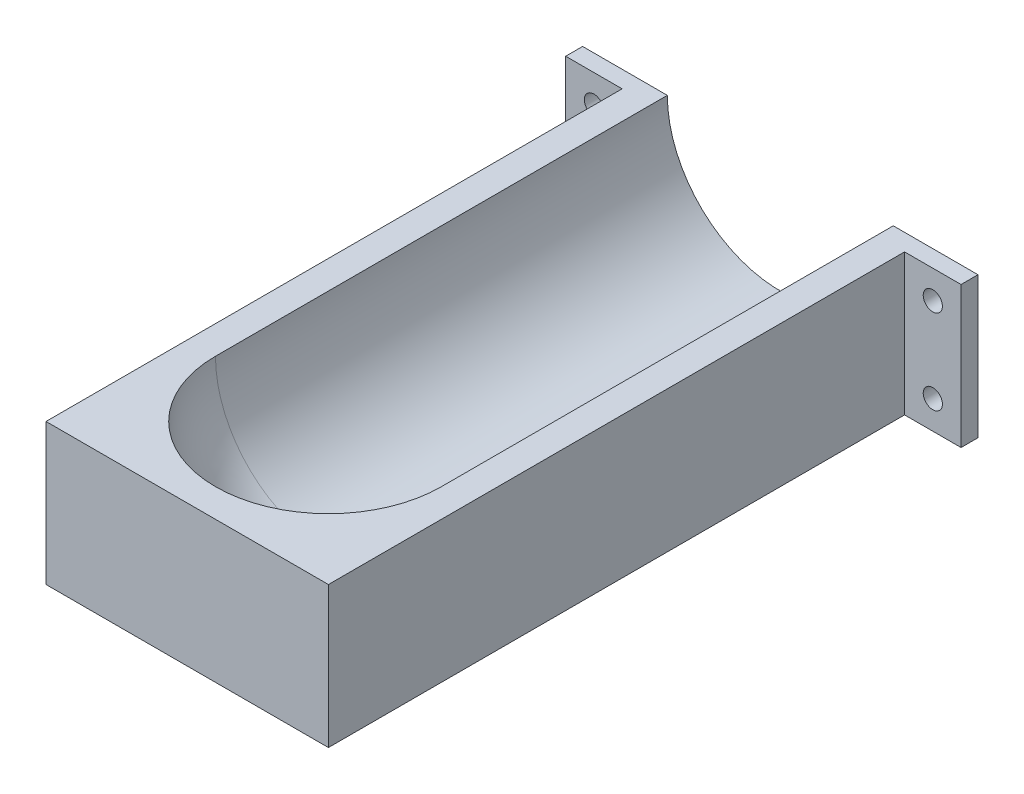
ISO-10303-21;
HEADER;
FILE_DESCRIPTION(('STEP AP214'),'2;1');
FILE_NAME('part.step','',(''),(''),'','','');
FILE_SCHEMA(('AUTOMOTIVE_DESIGN { 1 0 10303 214 1 1 1 1 }'));
ENDSEC;
DATA;
#1=APPLICATION_CONTEXT('core data for automotive mechanical design processes');
#2=APPLICATION_PROTOCOL_DEFINITION('international standard','automotive_design',2000,#1);
#3=PRODUCT_CONTEXT('',#1,'mechanical');
#4=PRODUCT('Part','Part','',(#3));
#5=PRODUCT_RELATED_PRODUCT_CATEGORY('part','',(#4));
#6=PRODUCT_DEFINITION_FORMATION('','',#4);
#7=PRODUCT_DEFINITION_CONTEXT('part definition',#1,'design');
#8=PRODUCT_DEFINITION('design','',#6,#7);
#9=PRODUCT_DEFINITION_SHAPE('','',#8);
#10=(LENGTH_UNIT() NAMED_UNIT(*) SI_UNIT(.MILLI.,.METRE.));
#11=(NAMED_UNIT(*) PLANE_ANGLE_UNIT() SI_UNIT($,.RADIAN.));
#12=(NAMED_UNIT(*) SI_UNIT($,.STERADIAN.) SOLID_ANGLE_UNIT());
#13=UNCERTAINTY_MEASURE_WITH_UNIT(LENGTH_MEASURE(1.E-05),#10,'distance_accuracy_value','');
#14=(GEOMETRIC_REPRESENTATION_CONTEXT(3) GLOBAL_UNCERTAINTY_ASSIGNED_CONTEXT((#13)) GLOBAL_UNIT_ASSIGNED_CONTEXT((#10,
#11,#12)) REPRESENTATION_CONTEXT('',''));
#15=CARTESIAN_POINT('',(0.,0.,0.));
#16=DIRECTION('',(0.,0.,1.));
#17=DIRECTION('',(1.,0.,0.));
#18=AXIS2_PLACEMENT_3D('',#15,#16,#17);
#19=CARTESIAN_POINT('',(0.,0.,105.));
#20=DIRECTION('',(1.,0.,0.));
#21=DIRECTION('',(0.,0.,-1.));
#22=AXIS2_PLACEMENT_3D('',#19,#20,#21);
#23=PLANE('',#22);
#24=DIRECTION('',(0.,0.,-1.));
#25=VECTOR('',#24,1.);
#26=CARTESIAN_POINT('',(0.,25.,105.));
#27=LINE('',#26,#25);
#28=CARTESIAN_POINT('',(0.,25.,105.));
#29=VERTEX_POINT('',#28);
#30=CARTESIAN_POINT('',(0.,25.,3.));
#31=VERTEX_POINT('',#30);
#32=EDGE_CURVE('E212',#29,#31,#27,.T.);
#33=ORIENTED_EDGE('',*,*,#32,.T.);
#34=DIRECTION('',(0.,-1.,0.));
#35=VECTOR('',#34,1.);
#36=CARTESIAN_POINT('',(0.,25.,3.));
#37=LINE('',#36,#35);
#38=CARTESIAN_POINT('',(0.,0.,3.));
#39=VERTEX_POINT('',#38);
#40=EDGE_CURVE('E149',#31,#39,#37,.T.);
#41=ORIENTED_EDGE('',*,*,#40,.T.);
#42=DIRECTION('',(0.,0.,-1.));
#43=VECTOR('',#42,1.);
#44=CARTESIAN_POINT('',(0.,0.,105.));
#45=LINE('',#44,#43);
#46=CARTESIAN_POINT('',(0.,0.,105.));
#47=VERTEX_POINT('',#46);
#48=EDGE_CURVE('E147',#47,#39,#45,.T.);
#49=ORIENTED_EDGE('',*,*,#48,.F.);
#50=DIRECTION('',(0.,-1.,0.));
#51=VECTOR('',#50,1.);
#52=CARTESIAN_POINT('',(0.,0.,105.));
#53=LINE('',#52,#51);
#54=EDGE_CURVE('E198',#29,#47,#53,.T.);
#55=ORIENTED_EDGE('',*,*,#54,.F.);
#56=EDGE_LOOP('',(#33,#41,#49,#55));
#57=FACE_BOUND('',#56,.T.);
#58=ADVANCED_FACE('F43',(#57),#23,.F.);
#59=CARTESIAN_POINT('',(0.,0.,105.));
#60=DIRECTION('',(0.,1.,0.));
#61=DIRECTION('',(0.,0.,1.));
#62=AXIS2_PLACEMENT_3D('',#59,#60,#61);
#63=PLANE('',#62);
#64=DIRECTION('',(1.,0.,0.));
#65=VECTOR('',#64,1.);
#66=CARTESIAN_POINT('',(0.,0.,0.));
#67=LINE('',#66,#65);
#68=CARTESIAN_POINT('',(-10.,0.,0.));
#69=VERTEX_POINT('',#68);
#70=CARTESIAN_POINT('',(60.,0.,0.));
#71=VERTEX_POINT('',#70);
#72=EDGE_CURVE('E195',#69,#71,#67,.T.);
#73=ORIENTED_EDGE('',*,*,#72,.T.);
#74=DIRECTION('',(0.,0.,-1.));
#75=VECTOR('',#74,1.);
#76=CARTESIAN_POINT('',(60.,0.,3.));
#77=LINE('',#76,#75);
#78=CARTESIAN_POINT('',(60.,0.,3.));
#79=VERTEX_POINT('',#78);
#80=EDGE_CURVE('E180',#79,#71,#77,.T.);
#81=ORIENTED_EDGE('',*,*,#80,.F.);
#82=DIRECTION('',(-1.,0.,0.));
#83=VECTOR('',#82,1.);
#84=CARTESIAN_POINT('',(50.,0.,3.));
#85=LINE('',#84,#83);
#86=CARTESIAN_POINT('',(50.,0.,3.));
#87=VERTEX_POINT('',#86);
#88=EDGE_CURVE('E172',#79,#87,#85,.T.);
#89=ORIENTED_EDGE('',*,*,#88,.T.);
#90=DIRECTION('',(0.,0.,-1.));
#91=VECTOR('',#90,1.);
#92=CARTESIAN_POINT('',(50.,0.,105.));
#93=LINE('',#92,#91);
#94=CARTESIAN_POINT('',(50.,0.,105.));
#95=VERTEX_POINT('',#94);
#96=EDGE_CURVE('E226',#95,#87,#93,.T.);
#97=ORIENTED_EDGE('',*,*,#96,.F.);
#98=DIRECTION('',(1.,0.,0.));
#99=VECTOR('',#98,1.);
#100=CARTESIAN_POINT('',(0.,0.,105.));
#101=LINE('',#100,#99);
#102=EDGE_CURVE('E202',#47,#95,#101,.T.);
#103=ORIENTED_EDGE('',*,*,#102,.F.);
#104=ORIENTED_EDGE('',*,*,#48,.T.);
#105=DIRECTION('',(-1.,0.,0.));
#106=VECTOR('',#105,1.);
#107=CARTESIAN_POINT('',(0.,0.,3.));
#108=LINE('',#107,#106);
#109=CARTESIAN_POINT('',(-10.,0.,3.));
#110=VERTEX_POINT('',#109);
#111=EDGE_CURVE('E61',#39,#110,#108,.T.);
#112=ORIENTED_EDGE('',*,*,#111,.T.);
#113=DIRECTION('',(0.,0.,-1.));
#114=VECTOR('',#113,1.);
#115=CARTESIAN_POINT('',(-10.,0.,3.));
#116=LINE('',#115,#114);
#117=EDGE_CURVE('E128',#110,#69,#116,.T.);
#118=ORIENTED_EDGE('',*,*,#117,.T.);
#119=EDGE_LOOP('',(#73,#81,#89,#97,#103,#104,#112,#118));
#120=FACE_BOUND('',#119,.T.);
#121=ADVANCED_FACE('F145',(#120),#63,.F.);
#122=CARTESIAN_POINT('',(50.,0.,105.));
#123=DIRECTION('',(-1.,0.,0.));
#124=DIRECTION('',(0.,0.,1.));
#125=AXIS2_PLACEMENT_3D('',#122,#123,#124);
#126=PLANE('',#125);
#127=ORIENTED_EDGE('',*,*,#96,.T.);
#128=DIRECTION('',(0.,1.,0.));
#129=VECTOR('',#128,1.);
#130=CARTESIAN_POINT('',(50.,25.,3.));
#131=LINE('',#130,#129);
#132=CARTESIAN_POINT('',(50.,25.,3.));
#133=VERTEX_POINT('',#132);
#134=EDGE_CURVE('E163',#87,#133,#131,.T.);
#135=ORIENTED_EDGE('',*,*,#134,.T.);
#136=DIRECTION('',(0.,0.,-1.));
#137=VECTOR('',#136,1.);
#138=CARTESIAN_POINT('',(50.,25.,105.));
#139=LINE('',#138,#137);
#140=CARTESIAN_POINT('',(50.,25.,105.));
#141=VERTEX_POINT('',#140);
#142=EDGE_CURVE('E222',#141,#133,#139,.T.);
#143=ORIENTED_EDGE('',*,*,#142,.F.);
#144=DIRECTION('',(0.,1.,0.));
#145=VECTOR('',#144,1.);
#146=CARTESIAN_POINT('',(50.,0.,105.));
#147=LINE('',#146,#145);
#148=EDGE_CURVE('E206',#95,#141,#147,.T.);
#149=ORIENTED_EDGE('',*,*,#148,.F.);
#150=EDGE_LOOP('',(#127,#135,#143,#149));
#151=FACE_BOUND('',#150,.T.);
#152=ADVANCED_FACE('F300',(#151),#126,.F.);
#153=CARTESIAN_POINT('',(0.,25.,105.));
#154=DIRECTION('',(0.,-1.,0.));
#155=DIRECTION('',(0.,0.,-1.));
#156=AXIS2_PLACEMENT_3D('',#153,#154,#155);
#157=PLANE('',#156);
#158=CARTESIAN_POINT('',(25.,25.,80.));
#159=DIRECTION('',(0.,-1.,0.));
#160=DIRECTION('',(0.,0.,-1.));
#161=AXIS2_PLACEMENT_3D('',#158,#159,#160);
#162=CIRCLE('',#161,20.);
#163=CARTESIAN_POINT('',(45.,25.,80.));
#164=VERTEX_POINT('',#163);
#165=CARTESIAN_POINT('',(25.,25.,100.));
#166=VERTEX_POINT('',#165);
#167=EDGE_CURVE('E53',#164,#166,#162,.T.);
#168=ORIENTED_EDGE('',*,*,#167,.T.);
#169=CARTESIAN_POINT('',(25.,25.,80.));
#170=DIRECTION('',(0.,-1.,0.));
#171=DIRECTION('',(0.,0.,-1.));
#172=AXIS2_PLACEMENT_3D('',#169,#170,#171);
#173=CIRCLE('',#172,20.);
#174=CARTESIAN_POINT('',(5.00000000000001,25.,80.));
#175=VERTEX_POINT('',#174);
#176=EDGE_CURVE('E12',#166,#175,#173,.T.);
#177=ORIENTED_EDGE('',*,*,#176,.T.);
#178=DIRECTION('',(0.,0.,-1.));
#179=VECTOR('',#178,1.);
#180=CARTESIAN_POINT('',(5.00000000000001,25.,149.721359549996));
#181=LINE('',#180,#179);
#182=CARTESIAN_POINT('',(5.00000000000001,25.,0.));
#183=VERTEX_POINT('',#182);
#184=EDGE_CURVE('E191',#175,#183,#181,.T.);
#185=ORIENTED_EDGE('',*,*,#184,.T.);
#186=DIRECTION('',(-1.,0.,0.));
#187=VECTOR('',#186,1.);
#188=CARTESIAN_POINT('',(0.,25.,0.));
#189=LINE('',#188,#187);
#190=CARTESIAN_POINT('',(-10.,25.,0.));
#191=VERTEX_POINT('',#190);
#192=EDGE_CURVE('E215',#183,#191,#189,.T.);
#193=ORIENTED_EDGE('',*,*,#192,.T.);
#194=DIRECTION('',(0.,0.,-1.));
#195=VECTOR('',#194,1.);
#196=CARTESIAN_POINT('',(-10.,25.,3.));
#197=LINE('',#196,#195);
#198=CARTESIAN_POINT('',(-10.,25.,3.));
#199=VERTEX_POINT('',#198);
#200=EDGE_CURVE('E137',#199,#191,#197,.T.);
#201=ORIENTED_EDGE('',*,*,#200,.F.);
#202=DIRECTION('',(1.,0.,0.));
#203=VECTOR('',#202,1.);
#204=CARTESIAN_POINT('',(0.,25.,3.));
#205=LINE('',#204,#203);
#206=EDGE_CURVE('E138',#199,#31,#205,.T.);
#207=ORIENTED_EDGE('',*,*,#206,.T.);
#208=ORIENTED_EDGE('',*,*,#32,.F.);
#209=DIRECTION('',(-1.,0.,0.));
#210=VECTOR('',#209,1.);
#211=CARTESIAN_POINT('',(0.,25.,105.));
#212=LINE('',#211,#210);
#213=EDGE_CURVE('E209',#141,#29,#212,.T.);
#214=ORIENTED_EDGE('',*,*,#213,.F.);
#215=ORIENTED_EDGE('',*,*,#142,.T.);
#216=DIRECTION('',(1.,0.,0.));
#217=VECTOR('',#216,1.);
#218=CARTESIAN_POINT('',(50.,25.,3.));
#219=LINE('',#218,#217);
#220=CARTESIAN_POINT('',(60.,25.,3.));
#221=VERTEX_POINT('',#220);
#222=EDGE_CURVE('E69',#133,#221,#219,.T.);
#223=ORIENTED_EDGE('',*,*,#222,.T.);
#224=DIRECTION('',(0.,0.,-1.));
#225=VECTOR('',#224,1.);
#226=CARTESIAN_POINT('',(60.,25.,3.));
#227=LINE('',#226,#225);
#228=CARTESIAN_POINT('',(60.,25.,0.));
#229=VERTEX_POINT('',#228);
#230=EDGE_CURVE('E176',#221,#229,#227,.T.);
#231=ORIENTED_EDGE('',*,*,#230,.T.);
#232=CARTESIAN_POINT('',(45.,25.,0.));
#233=VERTEX_POINT('',#232);
#234=EDGE_CURVE('E203',#229,#233,#189,.T.);
#235=ORIENTED_EDGE('',*,*,#234,.T.);
#236=DIRECTION('',(0.,0.,-1.));
#237=VECTOR('',#236,1.);
#238=CARTESIAN_POINT('',(45.,25.,149.721359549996));
#239=LINE('',#238,#237);
#240=EDGE_CURVE('E192',#164,#233,#239,.T.);
#241=ORIENTED_EDGE('',*,*,#240,.F.);
#242=EDGE_LOOP('',(#168,#177,#185,#193,#201,#207,#208,#214,#215,#223,#231,#235,#241));
#243=FACE_BOUND('',#242,.T.);
#244=ADVANCED_FACE('F291',(#243),#157,.F.);
#245=CARTESIAN_POINT('',(0.,0.,105.));
#246=DIRECTION('',(0.,0.,-1.));
#247=DIRECTION('',(-1.,0.,0.));
#248=AXIS2_PLACEMENT_3D('',#245,#246,#247);
#249=PLANE('',#248);
#250=ORIENTED_EDGE('',*,*,#54,.T.);
#251=ORIENTED_EDGE('',*,*,#102,.T.);
#252=ORIENTED_EDGE('',*,*,#148,.T.);
#253=ORIENTED_EDGE('',*,*,#213,.T.);
#254=EDGE_LOOP('',(#250,#251,#252,#253));
#255=FACE_BOUND('',#254,.T.);
#256=ADVANCED_FACE('F278',(#255),#249,.F.);
#257=CARTESIAN_POINT('',(0.,0.,0.));
#258=DIRECTION('',(0.,0.,-1.));
#259=DIRECTION('',(-1.,0.,0.));
#260=AXIS2_PLACEMENT_3D('',#257,#258,#259);
#261=PLANE('',#260);
#262=CARTESIAN_POINT('',(55.,5.,0.));
#263=DIRECTION('',(0.,0.,-1.));
#264=DIRECTION('',(-1.,0.,0.));
#265=AXIS2_PLACEMENT_3D('',#262,#263,#264);
#266=CIRCLE('',#265,1.7);
#267=CARTESIAN_POINT('',(53.3,5.,0.));
#268=VERTEX_POINT('',#267);
#269=EDGE_CURVE('E246',#268,#268,#266,.T.);
#270=ORIENTED_EDGE('',*,*,#269,.F.);
#271=EDGE_LOOP('',(#270));
#272=FACE_BOUND('',#271,.T.);
#273=CARTESIAN_POINT('',(-4.99999999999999,20.,0.));
#274=DIRECTION('',(0.,0.,-1.));
#275=DIRECTION('',(-1.,0.,0.));
#276=AXIS2_PLACEMENT_3D('',#273,#274,#275);
#277=CIRCLE('',#276,1.7);
#278=CARTESIAN_POINT('',(-6.69999999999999,20.,0.));
#279=VERTEX_POINT('',#278);
#280=EDGE_CURVE('E264',#279,#279,#277,.T.);
#281=ORIENTED_EDGE('',*,*,#280,.F.);
#282=EDGE_LOOP('',(#281));
#283=FACE_BOUND('',#282,.T.);
#284=CARTESIAN_POINT('',(-5.,5.,0.));
#285=DIRECTION('',(0.,0.,-1.));
#286=DIRECTION('',(-1.,0.,0.));
#287=AXIS2_PLACEMENT_3D('',#284,#285,#286);
#288=CIRCLE('',#287,1.7);
#289=CARTESIAN_POINT('',(-6.7,5.,0.));
#290=VERTEX_POINT('',#289);
#291=EDGE_CURVE('E260',#290,#290,#288,.T.);
#292=ORIENTED_EDGE('',*,*,#291,.F.);
#293=EDGE_LOOP('',(#292));
#294=FACE_BOUND('',#293,.T.);
#295=CARTESIAN_POINT('',(55.,20.,0.));
#296=DIRECTION('',(0.,0.,-1.));
#297=DIRECTION('',(-1.,0.,0.));
#298=AXIS2_PLACEMENT_3D('',#295,#296,#297);
#299=CIRCLE('',#298,1.7);
#300=CARTESIAN_POINT('',(53.3,20.,0.));
#301=VERTEX_POINT('',#300);
#302=EDGE_CURVE('E241',#301,#301,#299,.T.);
#303=ORIENTED_EDGE('',*,*,#302,.F.);
#304=EDGE_LOOP('',(#303));
#305=FACE_BOUND('',#304,.T.);
#306=CARTESIAN_POINT('',(25.,25.,0.));
#307=DIRECTION('',(0.,0.,-1.));
#308=DIRECTION('',(1.,0.,0.));
#309=AXIS2_PLACEMENT_3D('',#306,#307,#308);
#310=CIRCLE('',#309,20.);
#311=EDGE_CURVE('E184',#233,#183,#310,.T.);
#312=ORIENTED_EDGE('',*,*,#311,.F.);
#313=ORIENTED_EDGE('',*,*,#234,.F.);
#314=DIRECTION('',(0.,-1.,0.));
#315=VECTOR('',#314,1.);
#316=CARTESIAN_POINT('',(60.,25.,0.));
#317=LINE('',#316,#315);
#318=EDGE_CURVE('E161',#229,#71,#317,.T.);
#319=ORIENTED_EDGE('',*,*,#318,.T.);
#320=ORIENTED_EDGE('',*,*,#72,.F.);
#321=DIRECTION('',(0.,1.,0.));
#322=VECTOR('',#321,1.);
#323=CARTESIAN_POINT('',(-10.,25.,0.));
#324=LINE('',#323,#322);
#325=EDGE_CURVE('E134',#69,#191,#324,.T.);
#326=ORIENTED_EDGE('',*,*,#325,.T.);
#327=ORIENTED_EDGE('',*,*,#192,.F.);
#328=EDGE_LOOP('',(#312,#313,#319,#320,#326,#327));
#329=FACE_BOUND('',#328,.T.);
#330=ADVANCED_FACE('F274',(#272,#283,#294,#305,#329),#261,.T.);
#331=CARTESIAN_POINT('',(25.,25.,149.721359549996));
#332=DIRECTION('',(0.,0.,-1.));
#333=DIRECTION('',(-1.,0.,0.));
#334=AXIS2_PLACEMENT_3D('',#331,#332,#333);
#335=CYLINDRICAL_SURFACE('',#334,20.);
#336=ORIENTED_EDGE('',*,*,#184,.F.);
#337=CARTESIAN_POINT('',(25.,25.,80.));
#338=DIRECTION('',(0.,0.,-1.));
#339=DIRECTION('',(-1.,0.,0.));
#340=AXIS2_PLACEMENT_3D('',#337,#338,#339);
#341=CIRCLE('',#340,20.);
#342=EDGE_CURVE('E232',#175,#164,#341,.F.);
#343=ORIENTED_EDGE('',*,*,#342,.T.);
#344=ORIENTED_EDGE('',*,*,#240,.T.);
#345=ORIENTED_EDGE('',*,*,#311,.T.);
#346=EDGE_LOOP('',(#336,#343,#344,#345));
#347=FACE_BOUND('',#346,.T.);
#348=ADVANCED_FACE('F277',(#347),#335,.F.);
#349=CARTESIAN_POINT('',(25.,25.,80.));
#350=DIRECTION('',(0.,0.,-1.));
#351=DIRECTION('',(-1.,0.,0.));
#352=AXIS2_PLACEMENT_3D('',#349,#350,#351);
#353=SPHERICAL_SURFACE('',#352,20.);
#354=ORIENTED_EDGE('',*,*,#342,.F.);
#355=ORIENTED_EDGE('',*,*,#176,.F.);
#356=ORIENTED_EDGE('',*,*,#167,.F.);
#357=EDGE_LOOP('',(#354,#355,#356));
#358=FACE_BOUND('',#357,.T.);
#359=ADVANCED_FACE('F45',(#358),#353,.F.);
#360=CARTESIAN_POINT('',(60.,25.,3.));
#361=DIRECTION('',(1.,0.,0.));
#362=DIRECTION('',(0.,1.,0.));
#363=AXIS2_PLACEMENT_3D('',#360,#361,#362);
#364=PLANE('',#363);
#365=ORIENTED_EDGE('',*,*,#318,.F.);
#366=ORIENTED_EDGE('',*,*,#230,.F.);
#367=DIRECTION('',(0.,-1.,0.));
#368=VECTOR('',#367,1.);
#369=CARTESIAN_POINT('',(60.,25.,3.));
#370=LINE('',#369,#368);
#371=EDGE_CURVE('E168',#221,#79,#370,.T.);
#372=ORIENTED_EDGE('',*,*,#371,.T.);
#373=ORIENTED_EDGE('',*,*,#80,.T.);
#374=EDGE_LOOP('',(#365,#366,#372,#373));
#375=FACE_BOUND('',#374,.T.);
#376=ADVANCED_FACE('F294',(#375),#364,.T.);
#377=CARTESIAN_POINT('',(0.,0.,3.));
#378=DIRECTION('',(0.,0.,1.));
#379=DIRECTION('',(1.,0.,0.));
#380=AXIS2_PLACEMENT_3D('',#377,#378,#379);
#381=PLANE('',#380);
#382=CARTESIAN_POINT('',(55.,5.,3.));
#383=DIRECTION('',(0.,0.,1.));
#384=DIRECTION('',(1.,0.,0.));
#385=AXIS2_PLACEMENT_3D('',#382,#383,#384);
#386=CIRCLE('',#385,1.7);
#387=CARTESIAN_POINT('',(56.7,5.,3.));
#388=VERTEX_POINT('',#387);
#389=EDGE_CURVE('E47',#388,#388,#386,.T.);
#390=ORIENTED_EDGE('',*,*,#389,.F.);
#391=EDGE_LOOP('',(#390));
#392=FACE_BOUND('',#391,.T.);
#393=CARTESIAN_POINT('',(55.,20.,3.));
#394=DIRECTION('',(0.,0.,1.));
#395=DIRECTION('',(1.,0.,0.));
#396=AXIS2_PLACEMENT_3D('',#393,#394,#395);
#397=CIRCLE('',#396,1.7);
#398=CARTESIAN_POINT('',(56.7,20.,3.));
#399=VERTEX_POINT('',#398);
#400=EDGE_CURVE('E159',#399,#399,#397,.T.);
#401=ORIENTED_EDGE('',*,*,#400,.F.);
#402=EDGE_LOOP('',(#401));
#403=FACE_BOUND('',#402,.T.);
#404=ORIENTED_EDGE('',*,*,#134,.F.);
#405=ORIENTED_EDGE('',*,*,#88,.F.);
#406=ORIENTED_EDGE('',*,*,#371,.F.);
#407=ORIENTED_EDGE('',*,*,#222,.F.);
#408=EDGE_LOOP('',(#404,#405,#406,#407));
#409=FACE_BOUND('',#408,.T.);
#410=ADVANCED_FACE('F297',(#392,#403,#409),#381,.T.);
#411=CARTESIAN_POINT('',(-10.,25.,3.));
#412=DIRECTION('',(-1.,0.,0.));
#413=DIRECTION('',(0.,-1.,0.));
#414=AXIS2_PLACEMENT_3D('',#411,#412,#413);
#415=PLANE('',#414);
#416=ORIENTED_EDGE('',*,*,#325,.F.);
#417=ORIENTED_EDGE('',*,*,#117,.F.);
#418=DIRECTION('',(0.,1.,0.));
#419=VECTOR('',#418,1.);
#420=CARTESIAN_POINT('',(-10.,25.,3.));
#421=LINE('',#420,#419);
#422=EDGE_CURVE('E131',#110,#199,#421,.T.);
#423=ORIENTED_EDGE('',*,*,#422,.T.);
#424=ORIENTED_EDGE('',*,*,#200,.T.);
#425=EDGE_LOOP('',(#416,#417,#423,#424));
#426=FACE_BOUND('',#425,.T.);
#427=ADVANCED_FACE('F129',(#426),#415,.T.);
#428=CARTESIAN_POINT('',(0.,0.,3.));
#429=DIRECTION('',(0.,0.,-1.));
#430=DIRECTION('',(-1.,0.,0.));
#431=AXIS2_PLACEMENT_3D('',#428,#429,#430);
#432=PLANE('',#431);
#433=CARTESIAN_POINT('',(-4.99999999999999,20.,3.));
#434=DIRECTION('',(0.,0.,-1.));
#435=DIRECTION('',(-1.,0.,0.));
#436=AXIS2_PLACEMENT_3D('',#433,#434,#435);
#437=CIRCLE('',#436,1.7);
#438=CARTESIAN_POINT('',(-6.69999999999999,20.,3.));
#439=VERTEX_POINT('',#438);
#440=EDGE_CURVE('E245',#439,#439,#437,.T.);
#441=ORIENTED_EDGE('',*,*,#440,.T.);
#442=EDGE_LOOP('',(#441));
#443=FACE_BOUND('',#442,.T.);
#444=CARTESIAN_POINT('',(-5.,5.,3.));
#445=DIRECTION('',(0.,0.,-1.));
#446=DIRECTION('',(-1.,0.,0.));
#447=AXIS2_PLACEMENT_3D('',#444,#445,#446);
#448=CIRCLE('',#447,1.7);
#449=CARTESIAN_POINT('',(-6.7,5.,3.));
#450=VERTEX_POINT('',#449);
#451=EDGE_CURVE('E242',#450,#450,#448,.T.);
#452=ORIENTED_EDGE('',*,*,#451,.T.);
#453=EDGE_LOOP('',(#452));
#454=FACE_BOUND('',#453,.T.);
#455=ORIENTED_EDGE('',*,*,#40,.F.);
#456=ORIENTED_EDGE('',*,*,#206,.F.);
#457=ORIENTED_EDGE('',*,*,#422,.F.);
#458=ORIENTED_EDGE('',*,*,#111,.F.);
#459=EDGE_LOOP('',(#455,#456,#457,#458));
#460=FACE_BOUND('',#459,.T.);
#461=ADVANCED_FACE('F140',(#443,#454,#460),#432,.F.);
#462=CARTESIAN_POINT('',(55.,20.,105.));
#463=DIRECTION('',(0.,0.,-1.));
#464=DIRECTION('',(-1.,0.,0.));
#465=AXIS2_PLACEMENT_3D('',#462,#463,#464);
#466=CYLINDRICAL_SURFACE('',#465,1.7);
#467=ORIENTED_EDGE('',*,*,#400,.T.);
#468=EDGE_LOOP('',(#467));
#469=FACE_BOUND('',#468,.T.);
#470=ORIENTED_EDGE('',*,*,#302,.T.);
#471=EDGE_LOOP('',(#470));
#472=FACE_BOUND('',#471,.T.);
#473=ADVANCED_FACE('F337',(#469,#472),#466,.F.);
#474=CARTESIAN_POINT('',(-5.,5.,105.));
#475=DIRECTION('',(0.,0.,-1.));
#476=DIRECTION('',(-1.,0.,0.));
#477=AXIS2_PLACEMENT_3D('',#474,#475,#476);
#478=CYLINDRICAL_SURFACE('',#477,1.7);
#479=ORIENTED_EDGE('',*,*,#291,.T.);
#480=EDGE_LOOP('',(#479));
#481=FACE_BOUND('',#480,.T.);
#482=ORIENTED_EDGE('',*,*,#451,.F.);
#483=EDGE_LOOP('',(#482));
#484=FACE_BOUND('',#483,.T.);
#485=ADVANCED_FACE('F340',(#481,#484),#478,.F.);
#486=CARTESIAN_POINT('',(-4.99999999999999,20.,105.));
#487=DIRECTION('',(0.,0.,-1.));
#488=DIRECTION('',(-1.,0.,0.));
#489=AXIS2_PLACEMENT_3D('',#486,#487,#488);
#490=CYLINDRICAL_SURFACE('',#489,1.7);
#491=ORIENTED_EDGE('',*,*,#280,.T.);
#492=EDGE_LOOP('',(#491));
#493=FACE_BOUND('',#492,.T.);
#494=ORIENTED_EDGE('',*,*,#440,.F.);
#495=EDGE_LOOP('',(#494));
#496=FACE_BOUND('',#495,.T.);
#497=ADVANCED_FACE('F344',(#493,#496),#490,.F.);
#498=CARTESIAN_POINT('',(55.,5.,105.));
#499=DIRECTION('',(0.,0.,-1.));
#500=DIRECTION('',(-1.,0.,0.));
#501=AXIS2_PLACEMENT_3D('',#498,#499,#500);
#502=CYLINDRICAL_SURFACE('',#501,1.7);
#503=ORIENTED_EDGE('',*,*,#389,.T.);
#504=EDGE_LOOP('',(#503));
#505=FACE_BOUND('',#504,.T.);
#506=ORIENTED_EDGE('',*,*,#269,.T.);
#507=EDGE_LOOP('',(#506));
#508=FACE_BOUND('',#507,.T.);
#509=ADVANCED_FACE('F272',(#505,#508),#502,.F.);
#510=CLOSED_SHELL('',(#58,#121,#152,#244,#256,#330,#348,#359,#376,#410,#427,#461,#473,#485,#497,#509));
#511=MANIFOLD_SOLID_BREP('B2',#510);
#512=ADVANCED_BREP_SHAPE_REPRESENTATION('',(#18,#511),#14);
#513=SHAPE_DEFINITION_REPRESENTATION(#9,#512);
ENDSEC;
END-ISO-10303-21;
